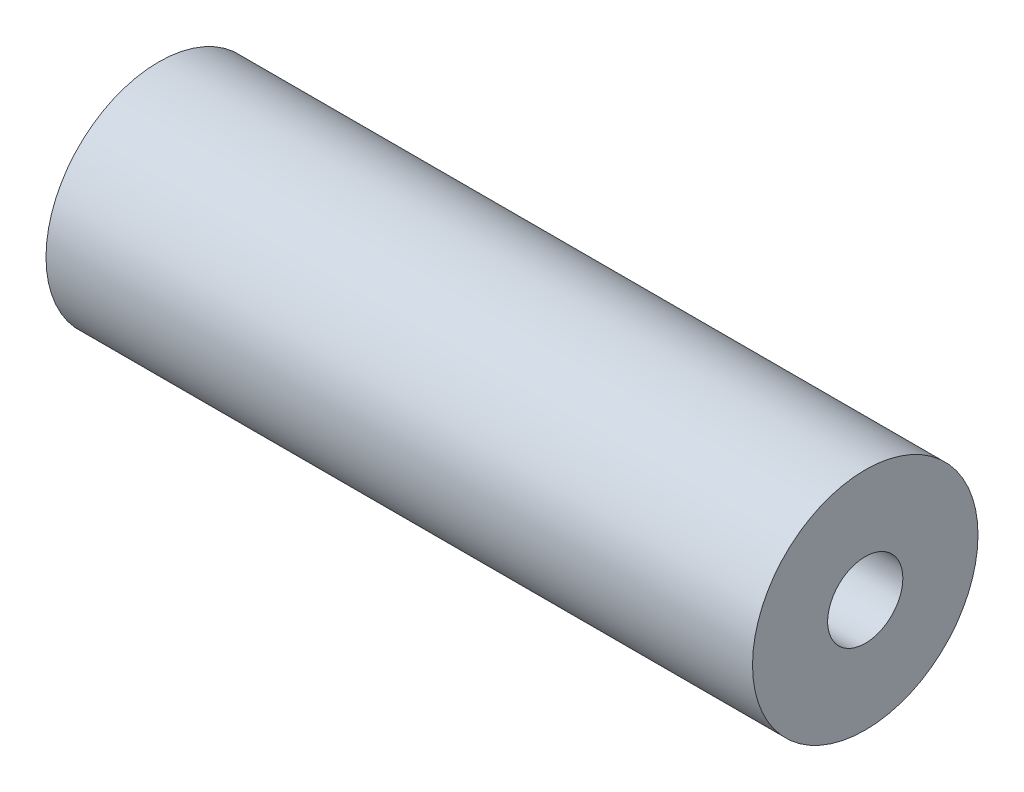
ISO-10303-21;
HEADER;
FILE_DESCRIPTION(('STEP AP214'),'2;1');
FILE_NAME('part.step','',(''),(''),'','','');
FILE_SCHEMA(('AUTOMOTIVE_DESIGN { 1 0 10303 214 1 1 1 1 }'));
ENDSEC;
DATA;
#1=APPLICATION_CONTEXT('core data for automotive mechanical design processes');
#2=APPLICATION_PROTOCOL_DEFINITION('international standard','automotive_design',2000,#1);
#3=PRODUCT_CONTEXT('',#1,'mechanical');
#4=PRODUCT('Part','Part','',(#3));
#5=PRODUCT_RELATED_PRODUCT_CATEGORY('part','',(#4));
#6=PRODUCT_DEFINITION_FORMATION('','',#4);
#7=PRODUCT_DEFINITION_CONTEXT('part definition',#1,'design');
#8=PRODUCT_DEFINITION('design','',#6,#7);
#9=PRODUCT_DEFINITION_SHAPE('','',#8);
#10=(LENGTH_UNIT() NAMED_UNIT(*) SI_UNIT(.MILLI.,.METRE.));
#11=(NAMED_UNIT(*) PLANE_ANGLE_UNIT() SI_UNIT($,.RADIAN.));
#12=(NAMED_UNIT(*) SI_UNIT($,.STERADIAN.) SOLID_ANGLE_UNIT());
#13=UNCERTAINTY_MEASURE_WITH_UNIT(LENGTH_MEASURE(1.E-05),#10,'distance_accuracy_value','');
#14=(GEOMETRIC_REPRESENTATION_CONTEXT(3) GLOBAL_UNCERTAINTY_ASSIGNED_CONTEXT((#13)) GLOBAL_UNIT_ASSIGNED_CONTEXT((#10,
#11,#12)) REPRESENTATION_CONTEXT('',''));
#15=CARTESIAN_POINT('',(0.,0.,0.));
#16=DIRECTION('',(0.,0.,1.));
#17=DIRECTION('',(1.,0.,0.));
#18=AXIS2_PLACEMENT_3D('',#15,#16,#17);
#19=CARTESIAN_POINT('',(47.,0.,0.));
#20=DIRECTION('',(1.,0.,0.));
#21=DIRECTION('',(0.,0.,-1.));
#22=AXIS2_PLACEMENT_3D('',#19,#20,#21);
#23=PLANE('',#22);
#24=CARTESIAN_POINT('',(47.,0.,0.));
#25=DIRECTION('',(1.,0.,0.));
#26=DIRECTION('',(0.,0.,-1.));
#27=AXIS2_PLACEMENT_3D('',#24,#25,#26);
#28=CIRCLE('',#27,7.5);
#29=CARTESIAN_POINT('',(47.,0.,-7.5));
#30=VERTEX_POINT('',#29);
#31=EDGE_CURVE('E10',#30,#30,#28,.T.);
#32=ORIENTED_EDGE('',*,*,#31,.T.);
#33=EDGE_LOOP('',(#32));
#34=FACE_BOUND('',#33,.T.);
#35=CARTESIAN_POINT('',(47.,0.,0.));
#36=DIRECTION('',(1.,0.,0.));
#37=DIRECTION('',(0.,0.,-1.));
#38=AXIS2_PLACEMENT_3D('',#35,#36,#37);
#39=CIRCLE('',#38,2.5);
#40=CARTESIAN_POINT('',(47.,0.,-2.5));
#41=VERTEX_POINT('',#40);
#42=EDGE_CURVE('E50',#41,#41,#39,.T.);
#43=ORIENTED_EDGE('',*,*,#42,.F.);
#44=EDGE_LOOP('',(#43));
#45=FACE_BOUND('',#44,.T.);
#46=ADVANCED_FACE('F39',(#34,#45),#23,.T.);
#47=CARTESIAN_POINT('',(0.,0.,0.));
#48=DIRECTION('',(1.,0.,0.));
#49=DIRECTION('',(0.,0.,-1.));
#50=AXIS2_PLACEMENT_3D('',#47,#48,#49);
#51=PLANE('',#50);
#52=CARTESIAN_POINT('',(0.,0.,0.));
#53=DIRECTION('',(1.,0.,0.));
#54=DIRECTION('',(0.,0.,-1.));
#55=AXIS2_PLACEMENT_3D('',#52,#53,#54);
#56=CIRCLE('',#55,7.5);
#57=CARTESIAN_POINT('',(0.,0.,-7.5));
#58=VERTEX_POINT('',#57);
#59=EDGE_CURVE('E43',#58,#58,#56,.T.);
#60=ORIENTED_EDGE('',*,*,#59,.F.);
#61=EDGE_LOOP('',(#60));
#62=FACE_BOUND('',#61,.T.);
#63=CARTESIAN_POINT('',(0.,0.,0.));
#64=DIRECTION('',(1.,0.,0.));
#65=DIRECTION('',(0.,0.,-1.));
#66=AXIS2_PLACEMENT_3D('',#63,#64,#65);
#67=CIRCLE('',#66,2.5);
#68=CARTESIAN_POINT('',(0.,0.,-2.5));
#69=VERTEX_POINT('',#68);
#70=EDGE_CURVE('E52',#69,#69,#67,.T.);
#71=ORIENTED_EDGE('',*,*,#70,.T.);
#72=EDGE_LOOP('',(#71));
#73=FACE_BOUND('',#72,.T.);
#74=ADVANCED_FACE('F62',(#62,#73),#51,.F.);
#75=CARTESIAN_POINT('',(47.,0.,0.));
#76=DIRECTION('',(-1.,0.,0.));
#77=DIRECTION('',(0.,0.,1.));
#78=AXIS2_PLACEMENT_3D('',#75,#76,#77);
#79=CYLINDRICAL_SURFACE('',#78,7.5);
#80=ORIENTED_EDGE('',*,*,#31,.F.);
#81=EDGE_LOOP('',(#80));
#82=FACE_BOUND('',#81,.T.);
#83=ORIENTED_EDGE('',*,*,#59,.T.);
#84=EDGE_LOOP('',(#83));
#85=FACE_BOUND('',#84,.T.);
#86=ADVANCED_FACE('F41',(#82,#85),#79,.T.);
#87=CARTESIAN_POINT('',(47.,0.,0.));
#88=DIRECTION('',(-1.,0.,0.));
#89=DIRECTION('',(0.,0.,1.));
#90=AXIS2_PLACEMENT_3D('',#87,#88,#89);
#91=CYLINDRICAL_SURFACE('',#90,2.5);
#92=ORIENTED_EDGE('',*,*,#42,.T.);
#93=EDGE_LOOP('',(#92));
#94=FACE_BOUND('',#93,.T.);
#95=ORIENTED_EDGE('',*,*,#70,.F.);
#96=EDGE_LOOP('',(#95));
#97=FACE_BOUND('',#96,.T.);
#98=ADVANCED_FACE('F58',(#94,#97),#91,.F.);
#99=CLOSED_SHELL('',(#46,#74,#86,#98));
#100=MANIFOLD_SOLID_BREP('B2',#99);
#101=ADVANCED_BREP_SHAPE_REPRESENTATION('',(#18,#100),#14);
#102=SHAPE_DEFINITION_REPRESENTATION(#9,#101);
ENDSEC;
END-ISO-10303-21;
